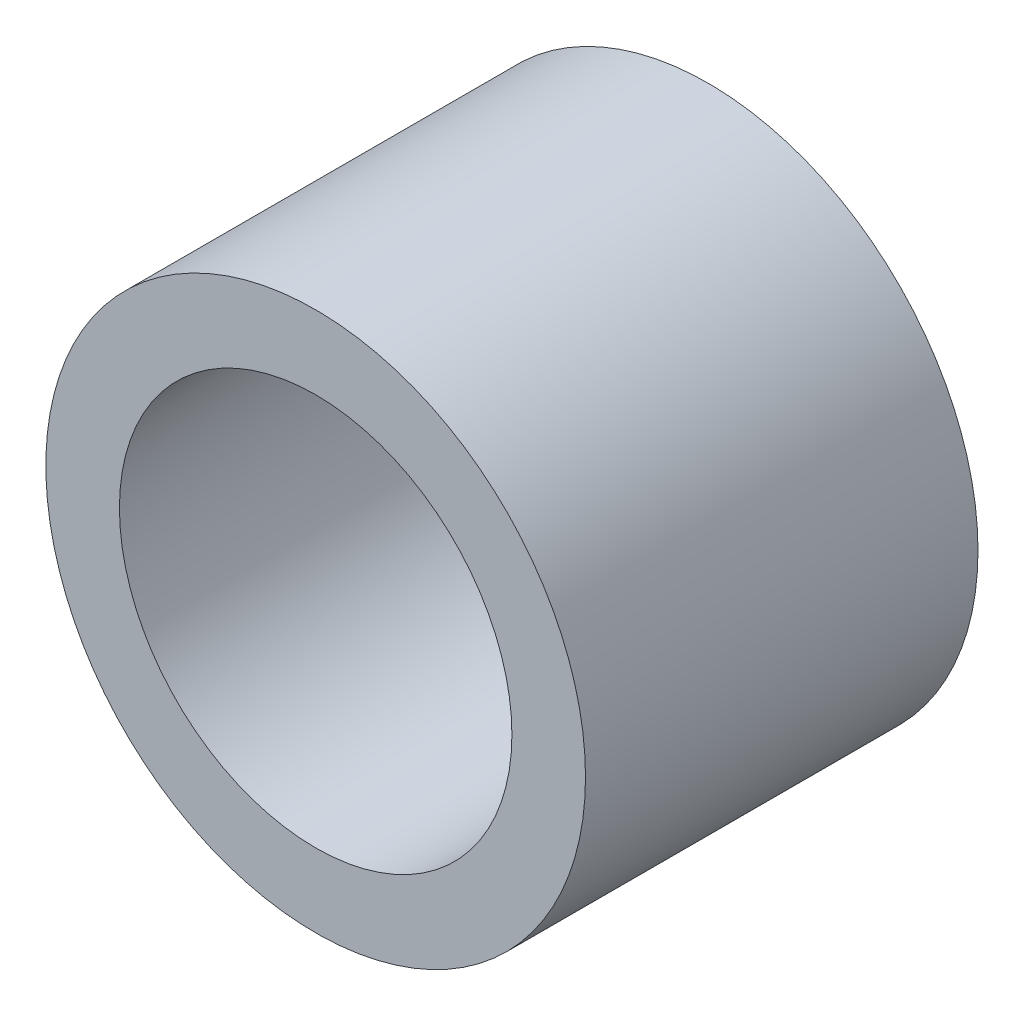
ISO-10303-21;
HEADER;
FILE_DESCRIPTION(('STEP AP214'),'2;1');
FILE_NAME('part.step','',(''),(''),'','','');
FILE_SCHEMA(('AUTOMOTIVE_DESIGN { 1 0 10303 214 1 1 1 1 }'));
ENDSEC;
DATA;
#1=APPLICATION_CONTEXT('core data for automotive mechanical design processes');
#2=APPLICATION_PROTOCOL_DEFINITION('international standard','automotive_design',2000,#1);
#3=PRODUCT_CONTEXT('',#1,'mechanical');
#4=PRODUCT('Part','Part','',(#3));
#5=PRODUCT_RELATED_PRODUCT_CATEGORY('part','',(#4));
#6=PRODUCT_DEFINITION_FORMATION('','',#4);
#7=PRODUCT_DEFINITION_CONTEXT('part definition',#1,'design');
#8=PRODUCT_DEFINITION('design','',#6,#7);
#9=PRODUCT_DEFINITION_SHAPE('','',#8);
#10=(LENGTH_UNIT() NAMED_UNIT(*) SI_UNIT(.MILLI.,.METRE.));
#11=(NAMED_UNIT(*) PLANE_ANGLE_UNIT() SI_UNIT($,.RADIAN.));
#12=(NAMED_UNIT(*) SI_UNIT($,.STERADIAN.) SOLID_ANGLE_UNIT());
#13=UNCERTAINTY_MEASURE_WITH_UNIT(LENGTH_MEASURE(1.E-05),#10,'distance_accuracy_value','');
#14=(GEOMETRIC_REPRESENTATION_CONTEXT(3) GLOBAL_UNCERTAINTY_ASSIGNED_CONTEXT((#13)) GLOBAL_UNIT_ASSIGNED_CONTEXT((#10,
#11,#12)) REPRESENTATION_CONTEXT('',''));
#15=CARTESIAN_POINT('',(0.,0.,0.));
#16=DIRECTION('',(0.,0.,1.));
#17=DIRECTION('',(1.,0.,0.));
#18=AXIS2_PLACEMENT_3D('',#15,#16,#17);
#19=CARTESIAN_POINT('',(0.,0.,16.));
#20=DIRECTION('',(0.,0.,1.));
#21=DIRECTION('',(1.,0.,0.));
#22=AXIS2_PLACEMENT_3D('',#19,#20,#21);
#23=PLANE('',#22);
#24=CARTESIAN_POINT('',(0.,0.,16.));
#25=DIRECTION('',(0.,0.,1.));
#26=DIRECTION('',(1.,0.,0.));
#27=AXIS2_PLACEMENT_3D('',#24,#25,#26);
#28=CIRCLE('',#27,11.);
#29=CARTESIAN_POINT('',(11.,0.,16.));
#30=VERTEX_POINT('',#29);
#31=EDGE_CURVE('E10',#30,#30,#28,.T.);
#32=ORIENTED_EDGE('',*,*,#31,.T.);
#33=EDGE_LOOP('',(#32));
#34=FACE_BOUND('',#33,.T.);
#35=CARTESIAN_POINT('',(0.,0.,16.));
#36=DIRECTION('',(0.,0.,1.));
#37=DIRECTION('',(1.,0.,0.));
#38=AXIS2_PLACEMENT_3D('',#35,#36,#37);
#39=CIRCLE('',#38,8.);
#40=CARTESIAN_POINT('',(8.00000000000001,0.,16.));
#41=VERTEX_POINT('',#40);
#42=EDGE_CURVE('E43',#41,#41,#39,.T.);
#43=ORIENTED_EDGE('',*,*,#42,.F.);
#44=EDGE_LOOP('',(#43));
#45=FACE_BOUND('',#44,.T.);
#46=ADVANCED_FACE('F32',(#34,#45),#23,.T.);
#47=CARTESIAN_POINT('',(0.,0.,0.));
#48=DIRECTION('',(0.,0.,1.));
#49=DIRECTION('',(1.,0.,0.));
#50=AXIS2_PLACEMENT_3D('',#47,#48,#49);
#51=PLANE('',#50);
#52=CARTESIAN_POINT('',(0.,0.,0.));
#53=DIRECTION('',(0.,0.,1.));
#54=DIRECTION('',(1.,0.,0.));
#55=AXIS2_PLACEMENT_3D('',#52,#53,#54);
#56=CIRCLE('',#55,11.);
#57=CARTESIAN_POINT('',(11.,0.,0.));
#58=VERTEX_POINT('',#57);
#59=EDGE_CURVE('E39',#58,#58,#56,.T.);
#60=ORIENTED_EDGE('',*,*,#59,.F.);
#61=EDGE_LOOP('',(#60));
#62=FACE_BOUND('',#61,.T.);
#63=CARTESIAN_POINT('',(0.,0.,0.));
#64=DIRECTION('',(0.,0.,1.));
#65=DIRECTION('',(1.,0.,0.));
#66=AXIS2_PLACEMENT_3D('',#63,#64,#65);
#67=CIRCLE('',#66,8.);
#68=CARTESIAN_POINT('',(8.00000000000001,0.,0.));
#69=VERTEX_POINT('',#68);
#70=EDGE_CURVE('E47',#69,#69,#67,.T.);
#71=ORIENTED_EDGE('',*,*,#70,.T.);
#72=EDGE_LOOP('',(#71));
#73=FACE_BOUND('',#72,.T.);
#74=ADVANCED_FACE('F53',(#62,#73),#51,.F.);
#75=CARTESIAN_POINT('',(0.,0.,16.));
#76=DIRECTION('',(0.,0.,-1.));
#77=DIRECTION('',(-1.,0.,0.));
#78=AXIS2_PLACEMENT_3D('',#75,#76,#77);
#79=CYLINDRICAL_SURFACE('',#78,11.);
#80=ORIENTED_EDGE('',*,*,#31,.F.);
#81=EDGE_LOOP('',(#80));
#82=FACE_BOUND('',#81,.T.);
#83=ORIENTED_EDGE('',*,*,#59,.T.);
#84=EDGE_LOOP('',(#83));
#85=FACE_BOUND('',#84,.T.);
#86=ADVANCED_FACE('F34',(#82,#85),#79,.T.);
#87=CARTESIAN_POINT('',(0.,0.,16.));
#88=DIRECTION('',(0.,0.,-1.));
#89=DIRECTION('',(-1.,0.,0.));
#90=AXIS2_PLACEMENT_3D('',#87,#88,#89);
#91=CYLINDRICAL_SURFACE('',#90,8.);
#92=ORIENTED_EDGE('',*,*,#42,.T.);
#93=EDGE_LOOP('',(#92));
#94=FACE_BOUND('',#93,.T.);
#95=ORIENTED_EDGE('',*,*,#70,.F.);
#96=EDGE_LOOP('',(#95));
#97=FACE_BOUND('',#96,.T.);
#98=ADVANCED_FACE('F55',(#94,#97),#91,.F.);
#99=CLOSED_SHELL('',(#46,#74,#86,#98));
#100=MANIFOLD_SOLID_BREP('B2',#99);
#101=ADVANCED_BREP_SHAPE_REPRESENTATION('',(#18,#100),#14);
#102=SHAPE_DEFINITION_REPRESENTATION(#9,#101);
ENDSEC;
END-ISO-10303-21;
